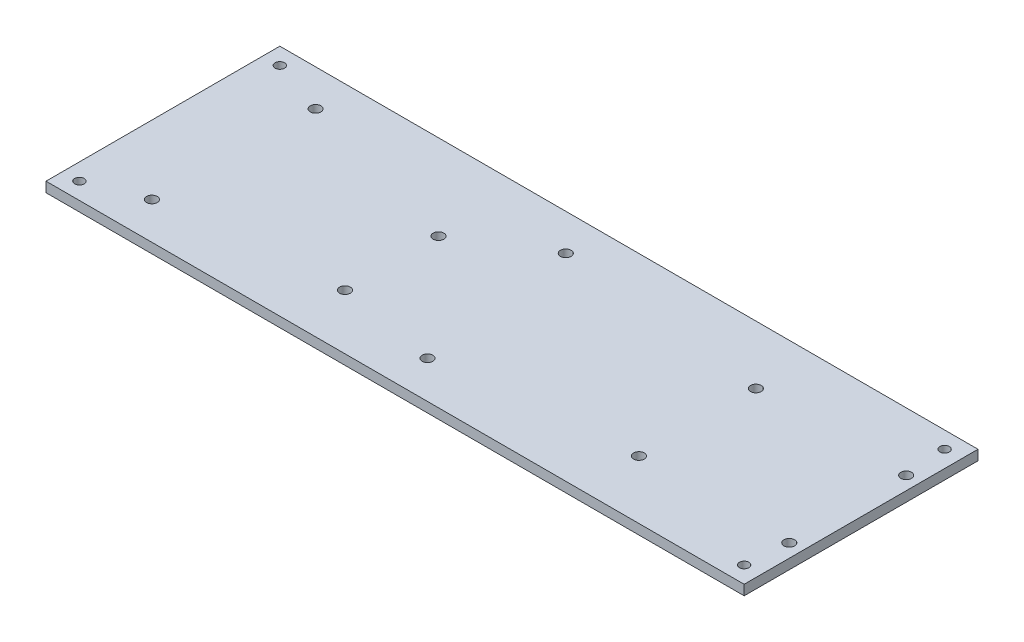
ISO-10303-21;
HEADER;
FILE_DESCRIPTION(('STEP AP214'),'2;1');
FILE_NAME('part.step','',(''),(''),'','','');
FILE_SCHEMA(('AUTOMOTIVE_DESIGN { 1 0 10303 214 1 1 1 1 }'));
ENDSEC;
DATA;
#1=APPLICATION_CONTEXT('core data for automotive mechanical design processes');
#2=APPLICATION_PROTOCOL_DEFINITION('international standard','automotive_design',2000,#1);
#3=PRODUCT_CONTEXT('',#1,'mechanical');
#4=PRODUCT('Part','Part','',(#3));
#5=PRODUCT_RELATED_PRODUCT_CATEGORY('part','',(#4));
#6=PRODUCT_DEFINITION_FORMATION('','',#4);
#7=PRODUCT_DEFINITION_CONTEXT('part definition',#1,'design');
#8=PRODUCT_DEFINITION('design','',#6,#7);
#9=PRODUCT_DEFINITION_SHAPE('','',#8);
#10=(LENGTH_UNIT() NAMED_UNIT(*) SI_UNIT(.MILLI.,.METRE.));
#11=(NAMED_UNIT(*) PLANE_ANGLE_UNIT() SI_UNIT($,.RADIAN.));
#12=(NAMED_UNIT(*) SI_UNIT($,.STERADIAN.) SOLID_ANGLE_UNIT());
#13=UNCERTAINTY_MEASURE_WITH_UNIT(LENGTH_MEASURE(1.E-05),#10,'distance_accuracy_value','');
#14=(GEOMETRIC_REPRESENTATION_CONTEXT(3) GLOBAL_UNCERTAINTY_ASSIGNED_CONTEXT((#13)) GLOBAL_UNIT_ASSIGNED_CONTEXT((#10,
#11,#12)) REPRESENTATION_CONTEXT('',''));
#15=CARTESIAN_POINT('',(0.,0.,0.));
#16=DIRECTION('',(0.,0.,1.));
#17=DIRECTION('',(1.,0.,0.));
#18=AXIS2_PLACEMENT_3D('',#15,#16,#17);
#19=CARTESIAN_POINT('',(0.,3.,0.));
#20=DIRECTION('',(0.,1.,0.));
#21=DIRECTION('',(0.,0.,1.));
#22=AXIS2_PLACEMENT_3D('',#19,#20,#21);
#23=PLANE('',#22);
#24=CARTESIAN_POINT('',(-99.4999999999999,3.,30.));
#25=DIRECTION('',(0.,-1.,0.));
#26=DIRECTION('',(0.,0.,-1.));
#27=AXIS2_PLACEMENT_3D('',#24,#25,#26);
#28=CIRCLE('',#27,1.42000000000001);
#29=CARTESIAN_POINT('',(-99.4999999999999,3.,28.58));
#30=VERTEX_POINT('',#29);
#31=EDGE_CURVE('E184',#30,#30,#28,.T.);
#32=ORIENTED_EDGE('',*,*,#31,.T.);
#33=EDGE_LOOP('',(#32));
#34=FACE_BOUND('',#33,.T.);
#35=CARTESIAN_POINT('',(-99.4999999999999,3.,-30.));
#36=DIRECTION('',(0.,1.,0.));
#37=DIRECTION('',(0.,0.,1.));
#38=AXIS2_PLACEMENT_3D('',#35,#36,#37);
#39=CIRCLE('',#38,1.42000000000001);
#40=CARTESIAN_POINT('',(-99.4999999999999,3.,-28.58));
#41=VERTEX_POINT('',#40);
#42=EDGE_CURVE('E181',#41,#41,#39,.T.);
#43=ORIENTED_EDGE('',*,*,#42,.F.);
#44=EDGE_LOOP('',(#43));
#45=FACE_BOUND('',#44,.T.);
#46=CARTESIAN_POINT('',(55.5000000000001,3.,17.5));
#47=DIRECTION('',(0.,1.,0.));
#48=DIRECTION('',(0.,0.,1.));
#49=AXIS2_PLACEMENT_3D('',#46,#47,#48);
#50=CIRCLE('',#49,1.6);
#51=CARTESIAN_POINT('',(55.5000000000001,3.,19.1));
#52=VERTEX_POINT('',#51);
#53=EDGE_CURVE('E170',#52,#52,#50,.T.);
#54=ORIENTED_EDGE('',*,*,#53,.F.);
#55=EDGE_LOOP('',(#54));
#56=FACE_BOUND('',#55,.T.);
#57=CARTESIAN_POINT('',(100.5,3.,-17.5));
#58=DIRECTION('',(0.,1.,0.));
#59=DIRECTION('',(0.,0.,1.));
#60=AXIS2_PLACEMENT_3D('',#57,#58,#59);
#61=CIRCLE('',#60,1.6);
#62=CARTESIAN_POINT('',(100.5,3.,-15.9));
#63=VERTEX_POINT('',#62);
#64=EDGE_CURVE('E163',#63,#63,#61,.T.);
#65=ORIENTED_EDGE('',*,*,#64,.F.);
#66=EDGE_LOOP('',(#65));
#67=FACE_BOUND('',#66,.T.);
#68=CARTESIAN_POINT('',(100.5,3.,17.5));
#69=DIRECTION('',(0.,1.,0.));
#70=DIRECTION('',(0.,0.,1.));
#71=AXIS2_PLACEMENT_3D('',#68,#69,#70);
#72=CIRCLE('',#71,1.6);
#73=CARTESIAN_POINT('',(100.5,3.,19.1));
#74=VERTEX_POINT('',#73);
#75=EDGE_CURVE('E175',#74,#74,#72,.T.);
#76=ORIENTED_EDGE('',*,*,#75,.F.);
#77=EDGE_LOOP('',(#76));
#78=FACE_BOUND('',#77,.T.);
#79=CARTESIAN_POINT('',(55.5,3.,-17.5));
#80=DIRECTION('',(0.,1.,0.));
#81=DIRECTION('',(0.,0.,1.));
#82=AXIS2_PLACEMENT_3D('',#79,#80,#81);
#83=CIRCLE('',#82,1.6);
#84=CARTESIAN_POINT('',(55.5,3.,-15.9));
#85=VERTEX_POINT('',#84);
#86=EDGE_CURVE('E157',#85,#85,#83,.T.);
#87=ORIENTED_EDGE('',*,*,#86,.F.);
#88=EDGE_LOOP('',(#87));
#89=FACE_BOUND('',#88,.T.);
#90=CARTESIAN_POINT('',(-31.4999999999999,3.,-9.50000000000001));
#91=DIRECTION('',(0.,1.,0.));
#92=DIRECTION('',(0.,0.,1.));
#93=AXIS2_PLACEMENT_3D('',#90,#91,#92);
#94=CIRCLE('',#93,1.6);
#95=CARTESIAN_POINT('',(-31.4999999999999,3.,-7.90000000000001));
#96=VERTEX_POINT('',#95);
#97=EDGE_CURVE('E139',#96,#96,#94,.T.);
#98=ORIENTED_EDGE('',*,*,#97,.F.);
#99=EDGE_LOOP('',(#98));
#100=FACE_BOUND('',#99,.T.);
#101=CARTESIAN_POINT('',(-1.49999999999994,3.,23.8));
#102=DIRECTION('',(0.,1.,0.));
#103=DIRECTION('',(0.,0.,1.));
#104=AXIS2_PLACEMENT_3D('',#101,#102,#103);
#105=CIRCLE('',#104,1.6);
#106=CARTESIAN_POINT('',(-1.49999999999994,3.,25.4));
#107=VERTEX_POINT('',#106);
#108=EDGE_CURVE('E146',#107,#107,#105,.T.);
#109=ORIENTED_EDGE('',*,*,#108,.F.);
#110=EDGE_LOOP('',(#109));
#111=FACE_BOUND('',#110,.T.);
#112=CARTESIAN_POINT('',(-7.99999999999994,3.,-24.1));
#113=DIRECTION('',(0.,1.,0.));
#114=DIRECTION('',(0.,0.,1.));
#115=AXIS2_PLACEMENT_3D('',#112,#113,#114);
#116=CIRCLE('',#115,1.6);
#117=CARTESIAN_POINT('',(-7.99999999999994,3.,-22.5));
#118=VERTEX_POINT('',#117);
#119=EDGE_CURVE('E127',#118,#118,#116,.T.);
#120=ORIENTED_EDGE('',*,*,#119,.F.);
#121=EDGE_LOOP('',(#120));
#122=FACE_BOUND('',#121,.T.);
#123=CARTESIAN_POINT('',(-83.8999999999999,3.,23.9));
#124=DIRECTION('',(0.,1.,0.));
#125=DIRECTION('',(0.,0.,1.));
#126=AXIS2_PLACEMENT_3D('',#123,#124,#125);
#127=CIRCLE('',#126,1.6);
#128=CARTESIAN_POINT('',(-83.8999999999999,3.,25.5));
#129=VERTEX_POINT('',#128);
#130=EDGE_CURVE('E134',#129,#129,#127,.T.);
#131=ORIENTED_EDGE('',*,*,#130,.F.);
#132=EDGE_LOOP('',(#131));
#133=FACE_BOUND('',#132,.T.);
#134=CARTESIAN_POINT('',(-31.4999999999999,3.,18.5));
#135=DIRECTION('',(0.,1.,0.));
#136=DIRECTION('',(0.,0.,1.));
#137=AXIS2_PLACEMENT_3D('',#134,#135,#136);
#138=CIRCLE('',#137,1.6);
#139=CARTESIAN_POINT('',(-31.4999999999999,3.,20.1));
#140=VERTEX_POINT('',#139);
#141=EDGE_CURVE('E151',#140,#140,#138,.T.);
#142=ORIENTED_EDGE('',*,*,#141,.F.);
#143=EDGE_LOOP('',(#142));
#144=FACE_BOUND('',#143,.T.);
#145=CARTESIAN_POINT('',(-82.8999999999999,3.,-24.1));
#146=DIRECTION('',(0.,1.,0.));
#147=DIRECTION('',(0.,0.,1.));
#148=AXIS2_PLACEMENT_3D('',#145,#146,#147);
#149=CIRCLE('',#148,1.6);
#150=CARTESIAN_POINT('',(-82.8999999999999,3.,-22.5));
#151=VERTEX_POINT('',#150);
#152=EDGE_CURVE('E121',#151,#151,#149,.T.);
#153=ORIENTED_EDGE('',*,*,#152,.F.);
#154=EDGE_LOOP('',(#153));
#155=FACE_BOUND('',#154,.T.);
#156=DIRECTION('',(0.,0.,-1.));
#157=VECTOR('',#156,1.);
#158=CARTESIAN_POINT('',(104.5,3.,-35.));
#159=LINE('',#158,#157);
#160=CARTESIAN_POINT('',(104.5,3.,35.));
#161=VERTEX_POINT('',#160);
#162=CARTESIAN_POINT('',(104.5,3.,-35.));
#163=VERTEX_POINT('',#162);
#164=EDGE_CURVE('E94',#161,#163,#159,.T.);
#165=ORIENTED_EDGE('',*,*,#164,.T.);
#166=DIRECTION('',(-1.,0.,0.));
#167=VECTOR('',#166,1.);
#168=CARTESIAN_POINT('',(-104.5,3.,-35.));
#169=LINE('',#168,#167);
#170=CARTESIAN_POINT('',(-104.5,3.,-35.));
#171=VERTEX_POINT('',#170);
#172=EDGE_CURVE('E89',#163,#171,#169,.T.);
#173=ORIENTED_EDGE('',*,*,#172,.T.);
#174=DIRECTION('',(0.,0.,1.));
#175=VECTOR('',#174,1.);
#176=CARTESIAN_POINT('',(-104.5,3.,-35.));
#177=LINE('',#176,#175);
#178=CARTESIAN_POINT('',(-104.5,3.,35.));
#179=VERTEX_POINT('',#178);
#180=EDGE_CURVE('E92',#171,#179,#177,.T.);
#181=ORIENTED_EDGE('',*,*,#180,.T.);
#182=DIRECTION('',(1.,0.,0.));
#183=VECTOR('',#182,1.);
#184=CARTESIAN_POINT('',(-104.5,3.,35.));
#185=LINE('',#184,#183);
#186=EDGE_CURVE('E59',#179,#161,#185,.T.);
#187=ORIENTED_EDGE('',*,*,#186,.T.);
#188=EDGE_LOOP('',(#165,#173,#181,#187));
#189=FACE_BOUND('',#188,.T.);
#190=CARTESIAN_POINT('',(99.4999999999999,3.,30.));
#191=DIRECTION('',(0.,1.,0.));
#192=DIRECTION('',(0.,0.,1.));
#193=AXIS2_PLACEMENT_3D('',#190,#191,#192);
#194=CIRCLE('',#193,1.42000000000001);
#195=CARTESIAN_POINT('',(99.4999999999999,3.,31.42));
#196=VERTEX_POINT('',#195);
#197=EDGE_CURVE('E196',#196,#196,#194,.T.);
#198=ORIENTED_EDGE('',*,*,#197,.F.);
#199=EDGE_LOOP('',(#198));
#200=FACE_BOUND('',#199,.T.);
#201=CARTESIAN_POINT('',(99.4999999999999,3.,-30.));
#202=DIRECTION('',(0.,-1.,0.));
#203=DIRECTION('',(0.,0.,-1.));
#204=AXIS2_PLACEMENT_3D('',#201,#202,#203);
#205=CIRCLE('',#204,1.42000000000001);
#206=CARTESIAN_POINT('',(99.4999999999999,3.,-31.42));
#207=VERTEX_POINT('',#206);
#208=EDGE_CURVE('E190',#207,#207,#205,.T.);
#209=ORIENTED_EDGE('',*,*,#208,.T.);
#210=EDGE_LOOP('',(#209));
#211=FACE_BOUND('',#210,.T.);
#212=ADVANCED_FACE('F42',(#34,#45,#56,#67,#78,#89,#100,#111,#122,#133,#144,#155,#189,#200,#211),
#23,.T.);
#213=CARTESIAN_POINT('',(0.,0.,0.));
#214=DIRECTION('',(0.,1.,0.));
#215=DIRECTION('',(0.,0.,1.));
#216=AXIS2_PLACEMENT_3D('',#213,#214,#215);
#217=PLANE('',#216);
#218=CARTESIAN_POINT('',(99.4999999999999,0.,30.));
#219=DIRECTION('',(0.,1.,0.));
#220=DIRECTION('',(0.,0.,1.));
#221=AXIS2_PLACEMENT_3D('',#218,#219,#220);
#222=CIRCLE('',#221,1.42000000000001);
#223=CARTESIAN_POINT('',(99.4999999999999,0.,31.42));
#224=VERTEX_POINT('',#223);
#225=EDGE_CURVE('E193',#224,#224,#222,.T.);
#226=ORIENTED_EDGE('',*,*,#225,.T.);
#227=EDGE_LOOP('',(#226));
#228=FACE_BOUND('',#227,.T.);
#229=CARTESIAN_POINT('',(-99.4999999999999,0.,-30.));
#230=DIRECTION('',(0.,1.,0.));
#231=DIRECTION('',(0.,0.,1.));
#232=AXIS2_PLACEMENT_3D('',#229,#230,#231);
#233=CIRCLE('',#232,1.42000000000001);
#234=CARTESIAN_POINT('',(-99.4999999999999,0.,-28.58));
#235=VERTEX_POINT('',#234);
#236=EDGE_CURVE('E178',#235,#235,#233,.T.);
#237=ORIENTED_EDGE('',*,*,#236,.T.);
#238=EDGE_LOOP('',(#237));
#239=FACE_BOUND('',#238,.T.);
#240=CARTESIAN_POINT('',(55.5000000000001,0.,17.5));
#241=DIRECTION('',(0.,1.,0.));
#242=DIRECTION('',(0.,0.,1.));
#243=AXIS2_PLACEMENT_3D('',#240,#241,#242);
#244=CIRCLE('',#243,1.6);
#245=CARTESIAN_POINT('',(55.5000000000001,0.,19.1));
#246=VERTEX_POINT('',#245);
#247=EDGE_CURVE('E160',#246,#246,#244,.T.);
#248=ORIENTED_EDGE('',*,*,#247,.T.);
#249=EDGE_LOOP('',(#248));
#250=FACE_BOUND('',#249,.T.);
#251=CARTESIAN_POINT('',(100.5,0.,-17.5));
#252=DIRECTION('',(0.,1.,0.));
#253=DIRECTION('',(0.,0.,1.));
#254=AXIS2_PLACEMENT_3D('',#251,#252,#253);
#255=CIRCLE('',#254,1.6);
#256=CARTESIAN_POINT('',(100.5,0.,-15.9));
#257=VERTEX_POINT('',#256);
#258=EDGE_CURVE('E166',#257,#257,#255,.T.);
#259=ORIENTED_EDGE('',*,*,#258,.T.);
#260=EDGE_LOOP('',(#259));
#261=FACE_BOUND('',#260,.T.);
#262=CARTESIAN_POINT('',(100.5,0.,17.5));
#263=DIRECTION('',(0.,1.,0.));
#264=DIRECTION('',(0.,0.,1.));
#265=AXIS2_PLACEMENT_3D('',#262,#263,#264);
#266=CIRCLE('',#265,1.6);
#267=CARTESIAN_POINT('',(100.5,0.,19.1));
#268=VERTEX_POINT('',#267);
#269=EDGE_CURVE('E167',#268,#268,#266,.T.);
#270=ORIENTED_EDGE('',*,*,#269,.T.);
#271=EDGE_LOOP('',(#270));
#272=FACE_BOUND('',#271,.T.);
#273=CARTESIAN_POINT('',(55.5,0.,-17.5));
#274=DIRECTION('',(0.,1.,0.));
#275=DIRECTION('',(0.,0.,1.));
#276=AXIS2_PLACEMENT_3D('',#273,#274,#275);
#277=CIRCLE('',#276,1.6);
#278=CARTESIAN_POINT('',(55.5,0.,-15.9));
#279=VERTEX_POINT('',#278);
#280=EDGE_CURVE('E154',#279,#279,#277,.T.);
#281=ORIENTED_EDGE('',*,*,#280,.T.);
#282=EDGE_LOOP('',(#281));
#283=FACE_BOUND('',#282,.T.);
#284=CARTESIAN_POINT('',(-31.4999999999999,0.,-9.50000000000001));
#285=DIRECTION('',(0.,1.,0.));
#286=DIRECTION('',(0.,0.,1.));
#287=AXIS2_PLACEMENT_3D('',#284,#285,#286);
#288=CIRCLE('',#287,1.6);
#289=CARTESIAN_POINT('',(-31.4999999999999,0.,-7.90000000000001));
#290=VERTEX_POINT('',#289);
#291=EDGE_CURVE('E142',#290,#290,#288,.T.);
#292=ORIENTED_EDGE('',*,*,#291,.T.);
#293=EDGE_LOOP('',(#292));
#294=FACE_BOUND('',#293,.T.);
#295=CARTESIAN_POINT('',(-1.49999999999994,0.,23.8));
#296=DIRECTION('',(0.,1.,0.));
#297=DIRECTION('',(0.,0.,1.));
#298=AXIS2_PLACEMENT_3D('',#295,#296,#297);
#299=CIRCLE('',#298,1.6);
#300=CARTESIAN_POINT('',(-1.49999999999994,0.,25.4));
#301=VERTEX_POINT('',#300);
#302=EDGE_CURVE('E131',#301,#301,#299,.T.);
#303=ORIENTED_EDGE('',*,*,#302,.T.);
#304=EDGE_LOOP('',(#303));
#305=FACE_BOUND('',#304,.T.);
#306=CARTESIAN_POINT('',(-7.99999999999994,0.,-24.1));
#307=DIRECTION('',(0.,1.,0.));
#308=DIRECTION('',(0.,0.,1.));
#309=AXIS2_PLACEMENT_3D('',#306,#307,#308);
#310=CIRCLE('',#309,1.6);
#311=CARTESIAN_POINT('',(-7.99999999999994,0.,-22.5));
#312=VERTEX_POINT('',#311);
#313=EDGE_CURVE('E130',#312,#312,#310,.T.);
#314=ORIENTED_EDGE('',*,*,#313,.T.);
#315=EDGE_LOOP('',(#314));
#316=FACE_BOUND('',#315,.T.);
#317=CARTESIAN_POINT('',(-83.8999999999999,0.,23.9));
#318=DIRECTION('',(0.,1.,0.));
#319=DIRECTION('',(0.,0.,1.));
#320=AXIS2_PLACEMENT_3D('',#317,#318,#319);
#321=CIRCLE('',#320,1.6);
#322=CARTESIAN_POINT('',(-83.8999999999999,0.,25.5));
#323=VERTEX_POINT('',#322);
#324=EDGE_CURVE('E124',#323,#323,#321,.T.);
#325=ORIENTED_EDGE('',*,*,#324,.T.);
#326=EDGE_LOOP('',(#325));
#327=FACE_BOUND('',#326,.T.);
#328=CARTESIAN_POINT('',(-31.4999999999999,0.,18.5));
#329=DIRECTION('',(0.,1.,0.));
#330=DIRECTION('',(0.,0.,1.));
#331=AXIS2_PLACEMENT_3D('',#328,#329,#330);
#332=CIRCLE('',#331,1.6);
#333=CARTESIAN_POINT('',(-31.4999999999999,0.,20.1));
#334=VERTEX_POINT('',#333);
#335=EDGE_CURVE('E143',#334,#334,#332,.T.);
#336=ORIENTED_EDGE('',*,*,#335,.T.);
#337=EDGE_LOOP('',(#336));
#338=FACE_BOUND('',#337,.T.);
#339=CARTESIAN_POINT('',(-82.8999999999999,0.,-24.1));
#340=DIRECTION('',(0.,1.,0.));
#341=DIRECTION('',(0.,0.,1.));
#342=AXIS2_PLACEMENT_3D('',#339,#340,#341);
#343=CIRCLE('',#342,1.6);
#344=CARTESIAN_POINT('',(-82.8999999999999,0.,-22.5));
#345=VERTEX_POINT('',#344);
#346=EDGE_CURVE('E109',#345,#345,#343,.T.);
#347=ORIENTED_EDGE('',*,*,#346,.T.);
#348=EDGE_LOOP('',(#347));
#349=FACE_BOUND('',#348,.T.);
#350=DIRECTION('',(0.,0.,-1.));
#351=VECTOR('',#350,1.);
#352=CARTESIAN_POINT('',(104.5,0.,-35.));
#353=LINE('',#352,#351);
#354=CARTESIAN_POINT('',(104.5,0.,35.));
#355=VERTEX_POINT('',#354);
#356=CARTESIAN_POINT('',(104.5,0.,-35.));
#357=VERTEX_POINT('',#356);
#358=EDGE_CURVE('E106',#355,#357,#353,.T.);
#359=ORIENTED_EDGE('',*,*,#358,.F.);
#360=DIRECTION('',(1.,0.,0.));
#361=VECTOR('',#360,1.);
#362=CARTESIAN_POINT('',(-104.5,0.,35.));
#363=LINE('',#362,#361);
#364=CARTESIAN_POINT('',(-104.5,0.,35.));
#365=VERTEX_POINT('',#364);
#366=EDGE_CURVE('E82',#365,#355,#363,.T.);
#367=ORIENTED_EDGE('',*,*,#366,.F.);
#368=DIRECTION('',(0.,0.,1.));
#369=VECTOR('',#368,1.);
#370=CARTESIAN_POINT('',(-104.5,0.,-35.));
#371=LINE('',#370,#369);
#372=CARTESIAN_POINT('',(-104.5,0.,-35.));
#373=VERTEX_POINT('',#372);
#374=EDGE_CURVE('E76',#373,#365,#371,.T.);
#375=ORIENTED_EDGE('',*,*,#374,.F.);
#376=DIRECTION('',(-1.,0.,0.));
#377=VECTOR('',#376,1.);
#378=CARTESIAN_POINT('',(-104.5,0.,-35.));
#379=LINE('',#378,#377);
#380=EDGE_CURVE('E98',#357,#373,#379,.T.);
#381=ORIENTED_EDGE('',*,*,#380,.F.);
#382=EDGE_LOOP('',(#359,#367,#375,#381));
#383=FACE_BOUND('',#382,.T.);
#384=CARTESIAN_POINT('',(-99.4999999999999,0.,30.));
#385=DIRECTION('',(0.,-1.,0.));
#386=DIRECTION('',(0.,0.,-1.));
#387=AXIS2_PLACEMENT_3D('',#384,#385,#386);
#388=CIRCLE('',#387,1.42000000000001);
#389=CARTESIAN_POINT('',(-99.4999999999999,0.,28.58));
#390=VERTEX_POINT('',#389);
#391=EDGE_CURVE('E199',#390,#390,#388,.T.);
#392=ORIENTED_EDGE('',*,*,#391,.F.);
#393=EDGE_LOOP('',(#392));
#394=FACE_BOUND('',#393,.T.);
#395=CARTESIAN_POINT('',(99.4999999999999,0.,-30.));
#396=DIRECTION('',(0.,-1.,0.));
#397=DIRECTION('',(0.,0.,-1.));
#398=AXIS2_PLACEMENT_3D('',#395,#396,#397);
#399=CIRCLE('',#398,1.42000000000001);
#400=CARTESIAN_POINT('',(99.4999999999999,0.,-31.42));
#401=VERTEX_POINT('',#400);
#402=EDGE_CURVE('E187',#401,#401,#399,.T.);
#403=ORIENTED_EDGE('',*,*,#402,.F.);
#404=EDGE_LOOP('',(#403));
#405=FACE_BOUND('',#404,.T.);
#406=ADVANCED_FACE('F117',(#228,#239,#250,#261,#272,#283,#294,#305,#316,#327,#338,#349,#383,
#394,#405),#217,.F.);
#407=CARTESIAN_POINT('',(104.5,3.,-35.));
#408=DIRECTION('',(-1.,0.,0.));
#409=DIRECTION('',(0.,0.,1.));
#410=AXIS2_PLACEMENT_3D('',#407,#408,#409);
#411=PLANE('',#410);
#412=ORIENTED_EDGE('',*,*,#358,.T.);
#413=DIRECTION('',(0.,-1.,0.));
#414=VECTOR('',#413,1.);
#415=CARTESIAN_POINT('',(104.5,3.,-35.));
#416=LINE('',#415,#414);
#417=EDGE_CURVE('E11',#163,#357,#416,.T.);
#418=ORIENTED_EDGE('',*,*,#417,.F.);
#419=ORIENTED_EDGE('',*,*,#164,.F.);
#420=DIRECTION('',(0.,-1.,0.));
#421=VECTOR('',#420,1.);
#422=CARTESIAN_POINT('',(104.5,3.,35.));
#423=LINE('',#422,#421);
#424=EDGE_CURVE('E102',#161,#355,#423,.T.);
#425=ORIENTED_EDGE('',*,*,#424,.T.);
#426=EDGE_LOOP('',(#412,#418,#419,#425));
#427=FACE_BOUND('',#426,.T.);
#428=ADVANCED_FACE('F44',(#427),#411,.F.);
#429=CARTESIAN_POINT('',(-104.5,3.,-35.));
#430=DIRECTION('',(0.,0.,1.));
#431=DIRECTION('',(1.,0.,0.));
#432=AXIS2_PLACEMENT_3D('',#429,#430,#431);
#433=PLANE('',#432);
#434=ORIENTED_EDGE('',*,*,#380,.T.);
#435=DIRECTION('',(0.,-1.,0.));
#436=VECTOR('',#435,1.);
#437=CARTESIAN_POINT('',(-104.5,3.,-35.));
#438=LINE('',#437,#436);
#439=EDGE_CURVE('E51',#171,#373,#438,.T.);
#440=ORIENTED_EDGE('',*,*,#439,.F.);
#441=ORIENTED_EDGE('',*,*,#172,.F.);
#442=ORIENTED_EDGE('',*,*,#417,.T.);
#443=EDGE_LOOP('',(#434,#440,#441,#442));
#444=FACE_BOUND('',#443,.T.);
#445=ADVANCED_FACE('F97',(#444),#433,.F.);
#446=CARTESIAN_POINT('',(-104.5,3.,-35.));
#447=DIRECTION('',(1.,0.,0.));
#448=DIRECTION('',(0.,0.,-1.));
#449=AXIS2_PLACEMENT_3D('',#446,#447,#448);
#450=PLANE('',#449);
#451=ORIENTED_EDGE('',*,*,#374,.T.);
#452=DIRECTION('',(0.,-1.,0.));
#453=VECTOR('',#452,1.);
#454=CARTESIAN_POINT('',(-104.5,3.,35.));
#455=LINE('',#454,#453);
#456=EDGE_CURVE('E99',#179,#365,#455,.T.);
#457=ORIENTED_EDGE('',*,*,#456,.F.);
#458=ORIENTED_EDGE('',*,*,#180,.F.);
#459=ORIENTED_EDGE('',*,*,#439,.T.);
#460=EDGE_LOOP('',(#451,#457,#458,#459));
#461=FACE_BOUND('',#460,.T.);
#462=ADVANCED_FACE('F100',(#461),#450,.F.);
#463=CARTESIAN_POINT('',(-104.5,3.,35.));
#464=DIRECTION('',(0.,0.,-1.));
#465=DIRECTION('',(-1.,0.,0.));
#466=AXIS2_PLACEMENT_3D('',#463,#464,#465);
#467=PLANE('',#466);
#468=ORIENTED_EDGE('',*,*,#366,.T.);
#469=ORIENTED_EDGE('',*,*,#424,.F.);
#470=ORIENTED_EDGE('',*,*,#186,.F.);
#471=ORIENTED_EDGE('',*,*,#456,.T.);
#472=EDGE_LOOP('',(#468,#469,#470,#471));
#473=FACE_BOUND('',#472,.T.);
#474=ADVANCED_FACE('F114',(#473),#467,.F.);
#475=CARTESIAN_POINT('',(-82.8999999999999,0.,-24.1));
#476=DIRECTION('',(0.,1.,0.));
#477=DIRECTION('',(0.,0.,1.));
#478=AXIS2_PLACEMENT_3D('',#475,#476,#477);
#479=CYLINDRICAL_SURFACE('',#478,1.6);
#480=ORIENTED_EDGE('',*,*,#346,.F.);
#481=EDGE_LOOP('',(#480));
#482=FACE_BOUND('',#481,.T.);
#483=ORIENTED_EDGE('',*,*,#152,.T.);
#484=EDGE_LOOP('',(#483));
#485=FACE_BOUND('',#484,.T.);
#486=ADVANCED_FACE('F231',(#482,#485),#479,.F.);
#487=CARTESIAN_POINT('',(-31.4999999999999,0.,18.5));
#488=DIRECTION('',(0.,1.,0.));
#489=DIRECTION('',(0.,0.,1.));
#490=AXIS2_PLACEMENT_3D('',#487,#488,#489);
#491=CYLINDRICAL_SURFACE('',#490,1.6);
#492=ORIENTED_EDGE('',*,*,#335,.F.);
#493=EDGE_LOOP('',(#492));
#494=FACE_BOUND('',#493,.T.);
#495=ORIENTED_EDGE('',*,*,#141,.T.);
#496=EDGE_LOOP('',(#495));
#497=FACE_BOUND('',#496,.T.);
#498=ADVANCED_FACE('F306',(#494,#497),#491,.F.);
#499=CARTESIAN_POINT('',(-83.8999999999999,0.,23.9));
#500=DIRECTION('',(0.,1.,0.));
#501=DIRECTION('',(0.,0.,1.));
#502=AXIS2_PLACEMENT_3D('',#499,#500,#501);
#503=CYLINDRICAL_SURFACE('',#502,1.6);
#504=ORIENTED_EDGE('',*,*,#324,.F.);
#505=EDGE_LOOP('',(#504));
#506=FACE_BOUND('',#505,.T.);
#507=ORIENTED_EDGE('',*,*,#130,.T.);
#508=EDGE_LOOP('',(#507));
#509=FACE_BOUND('',#508,.T.);
#510=ADVANCED_FACE('F309',(#506,#509),#503,.F.);
#511=CARTESIAN_POINT('',(-7.99999999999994,0.,-24.1));
#512=DIRECTION('',(0.,1.,0.));
#513=DIRECTION('',(0.,0.,1.));
#514=AXIS2_PLACEMENT_3D('',#511,#512,#513);
#515=CYLINDRICAL_SURFACE('',#514,1.6);
#516=ORIENTED_EDGE('',*,*,#313,.F.);
#517=EDGE_LOOP('',(#516));
#518=FACE_BOUND('',#517,.T.);
#519=ORIENTED_EDGE('',*,*,#119,.T.);
#520=EDGE_LOOP('',(#519));
#521=FACE_BOUND('',#520,.T.);
#522=ADVANCED_FACE('F314',(#518,#521),#515,.F.);
#523=CARTESIAN_POINT('',(-1.49999999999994,0.,23.8));
#524=DIRECTION('',(0.,1.,0.));
#525=DIRECTION('',(0.,0.,1.));
#526=AXIS2_PLACEMENT_3D('',#523,#524,#525);
#527=CYLINDRICAL_SURFACE('',#526,1.6);
#528=ORIENTED_EDGE('',*,*,#302,.F.);
#529=EDGE_LOOP('',(#528));
#530=FACE_BOUND('',#529,.T.);
#531=ORIENTED_EDGE('',*,*,#108,.T.);
#532=EDGE_LOOP('',(#531));
#533=FACE_BOUND('',#532,.T.);
#534=ADVANCED_FACE('F311',(#530,#533),#527,.F.);
#535=CARTESIAN_POINT('',(-31.4999999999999,0.,-9.50000000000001));
#536=DIRECTION('',(0.,1.,0.));
#537=DIRECTION('',(0.,0.,1.));
#538=AXIS2_PLACEMENT_3D('',#535,#536,#537);
#539=CYLINDRICAL_SURFACE('',#538,1.6);
#540=ORIENTED_EDGE('',*,*,#291,.F.);
#541=EDGE_LOOP('',(#540));
#542=FACE_BOUND('',#541,.T.);
#543=ORIENTED_EDGE('',*,*,#97,.T.);
#544=EDGE_LOOP('',(#543));
#545=FACE_BOUND('',#544,.T.);
#546=ADVANCED_FACE('F304',(#542,#545),#539,.F.);
#547=CARTESIAN_POINT('',(55.5,0.,-17.5));
#548=DIRECTION('',(0.,1.,0.));
#549=DIRECTION('',(0.,0.,1.));
#550=AXIS2_PLACEMENT_3D('',#547,#548,#549);
#551=CYLINDRICAL_SURFACE('',#550,1.6);
#552=ORIENTED_EDGE('',*,*,#280,.F.);
#553=EDGE_LOOP('',(#552));
#554=FACE_BOUND('',#553,.T.);
#555=ORIENTED_EDGE('',*,*,#86,.T.);
#556=EDGE_LOOP('',(#555));
#557=FACE_BOUND('',#556,.T.);
#558=ADVANCED_FACE('F295',(#554,#557),#551,.F.);
#559=CARTESIAN_POINT('',(100.5,0.,17.5));
#560=DIRECTION('',(0.,1.,0.));
#561=DIRECTION('',(0.,0.,1.));
#562=AXIS2_PLACEMENT_3D('',#559,#560,#561);
#563=CYLINDRICAL_SURFACE('',#562,1.6);
#564=ORIENTED_EDGE('',*,*,#269,.F.);
#565=EDGE_LOOP('',(#564));
#566=FACE_BOUND('',#565,.T.);
#567=ORIENTED_EDGE('',*,*,#75,.T.);
#568=EDGE_LOOP('',(#567));
#569=FACE_BOUND('',#568,.T.);
#570=ADVANCED_FACE('F291',(#566,#569),#563,.F.);
#571=CARTESIAN_POINT('',(100.5,0.,-17.5));
#572=DIRECTION('',(0.,1.,0.));
#573=DIRECTION('',(0.,0.,1.));
#574=AXIS2_PLACEMENT_3D('',#571,#572,#573);
#575=CYLINDRICAL_SURFACE('',#574,1.6);
#576=ORIENTED_EDGE('',*,*,#258,.F.);
#577=EDGE_LOOP('',(#576));
#578=FACE_BOUND('',#577,.T.);
#579=ORIENTED_EDGE('',*,*,#64,.T.);
#580=EDGE_LOOP('',(#579));
#581=FACE_BOUND('',#580,.T.);
#582=ADVANCED_FACE('F294',(#578,#581),#575,.F.);
#583=CARTESIAN_POINT('',(55.5000000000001,0.,17.5));
#584=DIRECTION('',(0.,1.,0.));
#585=DIRECTION('',(0.,0.,1.));
#586=AXIS2_PLACEMENT_3D('',#583,#584,#585);
#587=CYLINDRICAL_SURFACE('',#586,1.6);
#588=ORIENTED_EDGE('',*,*,#247,.F.);
#589=EDGE_LOOP('',(#588));
#590=FACE_BOUND('',#589,.T.);
#591=ORIENTED_EDGE('',*,*,#53,.T.);
#592=EDGE_LOOP('',(#591));
#593=FACE_BOUND('',#592,.T.);
#594=ADVANCED_FACE('F220',(#590,#593),#587,.F.);
#595=CARTESIAN_POINT('',(-99.4999999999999,0.,-30.));
#596=DIRECTION('',(0.,1.,0.));
#597=DIRECTION('',(0.,0.,1.));
#598=AXIS2_PLACEMENT_3D('',#595,#596,#597);
#599=CYLINDRICAL_SURFACE('',#598,1.42000000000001);
#600=ORIENTED_EDGE('',*,*,#236,.F.);
#601=EDGE_LOOP('',(#600));
#602=FACE_BOUND('',#601,.T.);
#603=ORIENTED_EDGE('',*,*,#42,.T.);
#604=EDGE_LOOP('',(#603));
#605=FACE_BOUND('',#604,.T.);
#606=ADVANCED_FACE('F210',(#602,#605),#599,.F.);
#607=CARTESIAN_POINT('',(-99.4999999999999,0.,30.));
#608=DIRECTION('',(0.,1.,0.));
#609=DIRECTION('',(0.,0.,1.));
#610=AXIS2_PLACEMENT_3D('',#607,#608,#609);
#611=CYLINDRICAL_SURFACE('',#610,1.42000000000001);
#612=ORIENTED_EDGE('',*,*,#391,.T.);
#613=EDGE_LOOP('',(#612));
#614=FACE_BOUND('',#613,.T.);
#615=ORIENTED_EDGE('',*,*,#31,.F.);
#616=EDGE_LOOP('',(#615));
#617=FACE_BOUND('',#616,.T.);
#618=ADVANCED_FACE('F207',(#614,#617),#611,.F.);
#619=CARTESIAN_POINT('',(99.4999999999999,0.,30.));
#620=DIRECTION('',(0.,1.,0.));
#621=DIRECTION('',(0.,0.,1.));
#622=AXIS2_PLACEMENT_3D('',#619,#620,#621);
#623=CYLINDRICAL_SURFACE('',#622,1.42000000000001);
#624=ORIENTED_EDGE('',*,*,#225,.F.);
#625=EDGE_LOOP('',(#624));
#626=FACE_BOUND('',#625,.T.);
#627=ORIENTED_EDGE('',*,*,#197,.T.);
#628=EDGE_LOOP('',(#627));
#629=FACE_BOUND('',#628,.T.);
#630=ADVANCED_FACE('F209',(#626,#629),#623,.F.);
#631=CARTESIAN_POINT('',(99.4999999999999,0.,-30.));
#632=DIRECTION('',(0.,1.,0.));
#633=DIRECTION('',(0.,0.,1.));
#634=AXIS2_PLACEMENT_3D('',#631,#632,#633);
#635=CYLINDRICAL_SURFACE('',#634,1.42000000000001);
#636=ORIENTED_EDGE('',*,*,#402,.T.);
#637=EDGE_LOOP('',(#636));
#638=FACE_BOUND('',#637,.T.);
#639=ORIENTED_EDGE('',*,*,#208,.F.);
#640=EDGE_LOOP('',(#639));
#641=FACE_BOUND('',#640,.T.);
#642=ADVANCED_FACE('F217',(#638,#641),#635,.F.);
#643=CLOSED_SHELL('',(#212,#406,#428,#445,#462,#474,#486,#498,#510,#522,#534,#546,#558,#570,
#582,#594,#606,#618,#630,#642));
#644=MANIFOLD_SOLID_BREP('B2',#643);
#645=ADVANCED_BREP_SHAPE_REPRESENTATION('',(#18,#644),#14);
#646=SHAPE_DEFINITION_REPRESENTATION(#9,#645);
ENDSEC;
END-ISO-10303-21;
